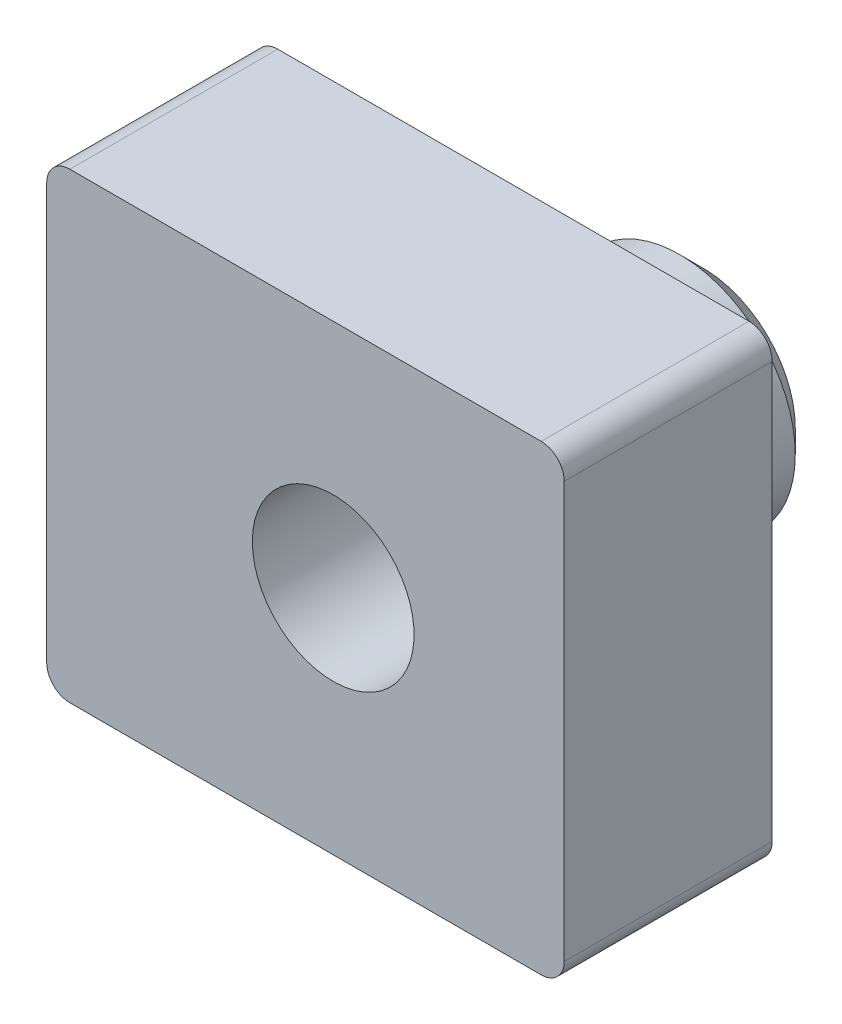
ISO-10303-21;
HEADER;
FILE_DESCRIPTION(('STEP AP214'),'2;1');
FILE_NAME('part.step','',(''),(''),'','','');
FILE_SCHEMA(('AUTOMOTIVE_DESIGN { 1 0 10303 214 1 1 1 1 }'));
ENDSEC;
DATA;
#1=APPLICATION_CONTEXT('core data for automotive mechanical design processes');
#2=APPLICATION_PROTOCOL_DEFINITION('international standard','automotive_design',2000,#1);
#3=PRODUCT_CONTEXT('',#1,'mechanical');
#4=PRODUCT('Part','Part','',(#3));
#5=PRODUCT_RELATED_PRODUCT_CATEGORY('part','',(#4));
#6=PRODUCT_DEFINITION_FORMATION('','',#4);
#7=PRODUCT_DEFINITION_CONTEXT('part definition',#1,'design');
#8=PRODUCT_DEFINITION('design','',#6,#7);
#9=PRODUCT_DEFINITION_SHAPE('','',#8);
#10=(LENGTH_UNIT() NAMED_UNIT(*) SI_UNIT(.MILLI.,.METRE.));
#11=(NAMED_UNIT(*) PLANE_ANGLE_UNIT() SI_UNIT($,.RADIAN.));
#12=(NAMED_UNIT(*) SI_UNIT($,.STERADIAN.) SOLID_ANGLE_UNIT());
#13=UNCERTAINTY_MEASURE_WITH_UNIT(LENGTH_MEASURE(1.E-05),#10,'distance_accuracy_value','');
#14=(GEOMETRIC_REPRESENTATION_CONTEXT(3) GLOBAL_UNCERTAINTY_ASSIGNED_CONTEXT((#13)) GLOBAL_UNIT_ASSIGNED_CONTEXT((#10,
#11,#12)) REPRESENTATION_CONTEXT('',''));
#15=CARTESIAN_POINT('',(0.,0.,0.));
#16=DIRECTION('',(0.,0.,1.));
#17=DIRECTION('',(1.,0.,0.));
#18=AXIS2_PLACEMENT_3D('',#15,#16,#17);
#19=CARTESIAN_POINT('',(10.,0.,-3.));
#20=DIRECTION('',(0.,0.,1.));
#21=DIRECTION('',(1.,0.,0.));
#22=AXIS2_PLACEMENT_3D('',#19,#20,#21);
#23=CYLINDRICAL_SURFACE('',#22,2.5);
#24=CARTESIAN_POINT('',(10.,0.,-2.5));
#25=DIRECTION('',(0.,0.,1.));
#26=DIRECTION('',(1.,0.,0.));
#27=AXIS2_PLACEMENT_3D('',#24,#25,#26);
#28=CIRCLE('',#27,2.5);
#29=CARTESIAN_POINT('',(12.5,0.,-2.5));
#30=VERTEX_POINT('',#29);
#31=EDGE_CURVE('E38',#30,#30,#28,.T.);
#32=ORIENTED_EDGE('',*,*,#31,.T.);
#33=EDGE_LOOP('',(#32));
#34=FACE_BOUND('',#33,.T.);
#35=CARTESIAN_POINT('',(10.,0.,0.));
#36=DIRECTION('',(0.,0.,1.));
#37=DIRECTION('',(1.,0.,0.));
#38=AXIS2_PLACEMENT_3D('',#35,#36,#37);
#39=CIRCLE('',#38,2.5);
#40=CARTESIAN_POINT('',(12.5,0.,0.));
#41=VERTEX_POINT('',#40);
#42=EDGE_CURVE('E224',#41,#41,#39,.T.);
#43=ORIENTED_EDGE('',*,*,#42,.F.);
#44=EDGE_LOOP('',(#43));
#45=FACE_BOUND('',#44,.T.);
#46=ADVANCED_FACE('F31',(#34,#45),#23,.T.);
#47=CARTESIAN_POINT('',(10.,0.,-3.));
#48=DIRECTION('',(0.,0.,1.));
#49=DIRECTION('',(1.,0.,0.));
#50=AXIS2_PLACEMENT_3D('',#47,#48,#49);
#51=PLANE('',#50);
#52=CARTESIAN_POINT('',(10.,0.,-3.));
#53=DIRECTION('',(0.,0.,-1.));
#54=DIRECTION('',(-1.,0.,0.));
#55=AXIS2_PLACEMENT_3D('',#52,#53,#54);
#56=CIRCLE('',#55,1.75);
#57=CARTESIAN_POINT('',(8.25,0.,-3.));
#58=VERTEX_POINT('',#57);
#59=EDGE_CURVE('E149',#58,#58,#56,.T.);
#60=ORIENTED_EDGE('',*,*,#59,.F.);
#61=EDGE_LOOP('',(#60));
#62=FACE_BOUND('',#61,.T.);
#63=CARTESIAN_POINT('',(10.,0.,-3.));
#64=DIRECTION('',(0.,0.,1.));
#65=DIRECTION('',(1.,0.,0.));
#66=AXIS2_PLACEMENT_3D('',#63,#64,#65);
#67=CIRCLE('',#66,2.);
#68=CARTESIAN_POINT('',(12.,0.,-3.));
#69=VERTEX_POINT('',#68);
#70=EDGE_CURVE('E11',#69,#69,#67,.F.);
#71=ORIENTED_EDGE('',*,*,#70,.T.);
#72=EDGE_LOOP('',(#71));
#73=FACE_BOUND('',#72,.T.);
#74=ADVANCED_FACE('F249',(#62,#73),#51,.F.);
#75=CARTESIAN_POINT('',(10.,0.,0.5));
#76=DIRECTION('',(0.,0.,-1.));
#77=DIRECTION('',(-1.,0.,0.));
#78=AXIS2_PLACEMENT_3D('',#75,#76,#77);
#79=CYLINDRICAL_SURFACE('',#78,3.975);
#80=CARTESIAN_POINT('',(10.,0.,0.));
#81=DIRECTION('',(0.,0.,1.));
#82=DIRECTION('',(1.,0.,0.));
#83=AXIS2_PLACEMENT_3D('',#80,#81,#82);
#84=CIRCLE('',#83,3.975);
#85=CARTESIAN_POINT('',(8.11568978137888,3.5,0.));
#86=VERTEX_POINT('',#85);
#87=CARTESIAN_POINT('',(8.11568978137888,-3.5,0.));
#88=VERTEX_POINT('',#87);
#89=EDGE_CURVE('E139',#86,#88,#84,.T.);
#90=ORIENTED_EDGE('',*,*,#89,.T.);
#91=DIRECTION('',(0.,0.,-1.));
#92=VECTOR('',#91,1.);
#93=CARTESIAN_POINT('',(8.11568978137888,-3.5,0.5));
#94=LINE('',#93,#92);
#95=CARTESIAN_POINT('',(8.11568978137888,-3.5,0.5));
#96=VERTEX_POINT('',#95);
#97=EDGE_CURVE('E221',#96,#88,#94,.T.);
#98=ORIENTED_EDGE('',*,*,#97,.F.);
#99=CARTESIAN_POINT('',(10.,0.,0.5));
#100=DIRECTION('',(0.,0.,1.));
#101=DIRECTION('',(1.,0.,0.));
#102=AXIS2_PLACEMENT_3D('',#99,#100,#101);
#103=CIRCLE('',#102,3.975);
#104=CARTESIAN_POINT('',(8.11568978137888,3.5,0.5));
#105=VERTEX_POINT('',#104);
#106=EDGE_CURVE('E204',#105,#96,#103,.T.);
#107=ORIENTED_EDGE('',*,*,#106,.F.);
#108=DIRECTION('',(0.,0.,-1.));
#109=VECTOR('',#108,1.);
#110=CARTESIAN_POINT('',(8.11568978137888,3.5,0.5));
#111=LINE('',#110,#109);
#112=EDGE_CURVE('E216',#105,#86,#111,.T.);
#113=ORIENTED_EDGE('',*,*,#112,.T.);
#114=EDGE_LOOP('',(#90,#98,#107,#113));
#115=FACE_BOUND('',#114,.T.);
#116=ADVANCED_FACE('F253',(#115),#79,.T.);
#117=CARTESIAN_POINT('',(8.11568978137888,-3.5,0.5));
#118=DIRECTION('',(0.,1.,0.));
#119=DIRECTION('',(0.,0.,1.));
#120=AXIS2_PLACEMENT_3D('',#117,#118,#119);
#121=PLANE('',#120);
#122=DIRECTION('',(1.,0.,0.));
#123=VECTOR('',#122,1.);
#124=CARTESIAN_POINT('',(8.11568978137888,-3.5,0.));
#125=LINE('',#124,#123);
#126=CARTESIAN_POINT('',(11.8843102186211,-3.5,0.));
#127=VERTEX_POINT('',#126);
#128=EDGE_CURVE('E198',#88,#127,#125,.T.);
#129=ORIENTED_EDGE('',*,*,#128,.T.);
#130=DIRECTION('',(0.,0.,-1.));
#131=VECTOR('',#130,1.);
#132=CARTESIAN_POINT('',(11.8843102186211,-3.5,0.5));
#133=LINE('',#132,#131);
#134=CARTESIAN_POINT('',(11.8843102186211,-3.5,0.5));
#135=VERTEX_POINT('',#134);
#136=EDGE_CURVE('E53',#135,#127,#133,.T.);
#137=ORIENTED_EDGE('',*,*,#136,.F.);
#138=DIRECTION('',(1.,0.,0.));
#139=VECTOR('',#138,1.);
#140=CARTESIAN_POINT('',(8.11568978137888,-3.5,0.5));
#141=LINE('',#140,#139);
#142=EDGE_CURVE('E207',#96,#135,#141,.T.);
#143=ORIENTED_EDGE('',*,*,#142,.F.);
#144=ORIENTED_EDGE('',*,*,#97,.T.);
#145=EDGE_LOOP('',(#129,#137,#143,#144));
#146=FACE_BOUND('',#145,.T.);
#147=ADVANCED_FACE('F258',(#146),#121,.F.);
#148=CARTESIAN_POINT('',(10.,0.,0.5));
#149=DIRECTION('',(0.,0.,-1.));
#150=DIRECTION('',(-1.,0.,0.));
#151=AXIS2_PLACEMENT_3D('',#148,#149,#150);
#152=CYLINDRICAL_SURFACE('',#151,3.975);
#153=CARTESIAN_POINT('',(10.,0.,0.));
#154=DIRECTION('',(0.,0.,1.));
#155=DIRECTION('',(1.,0.,0.));
#156=AXIS2_PLACEMENT_3D('',#153,#154,#155);
#157=CIRCLE('',#156,3.975);
#158=CARTESIAN_POINT('',(11.8843102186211,3.5,0.));
#159=VERTEX_POINT('',#158);
#160=EDGE_CURVE('E200',#127,#159,#157,.T.);
#161=ORIENTED_EDGE('',*,*,#160,.T.);
#162=DIRECTION('',(0.,0.,-1.));
#163=VECTOR('',#162,1.);
#164=CARTESIAN_POINT('',(11.8843102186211,3.5,0.5));
#165=LINE('',#164,#163);
#166=CARTESIAN_POINT('',(11.8843102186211,3.5,0.5));
#167=VERTEX_POINT('',#166);
#168=EDGE_CURVE('E45',#167,#159,#165,.T.);
#169=ORIENTED_EDGE('',*,*,#168,.F.);
#170=CARTESIAN_POINT('',(10.,0.,0.5));
#171=DIRECTION('',(0.,0.,1.));
#172=DIRECTION('',(1.,0.,0.));
#173=AXIS2_PLACEMENT_3D('',#170,#171,#172);
#174=CIRCLE('',#173,3.975);
#175=EDGE_CURVE('E210',#135,#167,#174,.T.);
#176=ORIENTED_EDGE('',*,*,#175,.F.);
#177=ORIENTED_EDGE('',*,*,#136,.T.);
#178=EDGE_LOOP('',(#161,#169,#176,#177));
#179=FACE_BOUND('',#178,.T.);
#180=ADVANCED_FACE('F266',(#179),#152,.T.);
#181=CARTESIAN_POINT('',(11.8843102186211,3.5,0.5));
#182=DIRECTION('',(0.,-1.,0.));
#183=DIRECTION('',(1.,0.,0.));
#184=AXIS2_PLACEMENT_3D('',#181,#182,#183);
#185=PLANE('',#184);
#186=DIRECTION('',(-1.,0.,0.));
#187=VECTOR('',#186,1.);
#188=CARTESIAN_POINT('',(11.8843102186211,3.5,0.));
#189=LINE('',#188,#187);
#190=EDGE_CURVE('E202',#159,#86,#189,.T.);
#191=ORIENTED_EDGE('',*,*,#190,.T.);
#192=ORIENTED_EDGE('',*,*,#112,.F.);
#193=DIRECTION('',(-1.,0.,0.));
#194=VECTOR('',#193,1.);
#195=CARTESIAN_POINT('',(11.8843102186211,3.5,0.5));
#196=LINE('',#195,#194);
#197=EDGE_CURVE('E213',#167,#105,#196,.T.);
#198=ORIENTED_EDGE('',*,*,#197,.F.);
#199=ORIENTED_EDGE('',*,*,#168,.T.);
#200=EDGE_LOOP('',(#191,#192,#198,#199));
#201=FACE_BOUND('',#200,.T.);
#202=ADVANCED_FACE('F269',(#201),#185,.F.);
#203=CARTESIAN_POINT('',(10.,0.,0.));
#204=DIRECTION('',(0.,0.,1.));
#205=DIRECTION('',(1.,0.,0.));
#206=AXIS2_PLACEMENT_3D('',#203,#204,#205);
#207=PLANE('',#206);
#208=ORIENTED_EDGE('',*,*,#42,.T.);
#209=EDGE_LOOP('',(#208));
#210=FACE_BOUND('',#209,.T.);
#211=ORIENTED_EDGE('',*,*,#89,.F.);
#212=ORIENTED_EDGE('',*,*,#190,.F.);
#213=ORIENTED_EDGE('',*,*,#160,.F.);
#214=ORIENTED_EDGE('',*,*,#128,.F.);
#215=EDGE_LOOP('',(#211,#212,#213,#214));
#216=FACE_BOUND('',#215,.T.);
#217=ADVANCED_FACE('F272',(#210,#216),#207,.F.);
#218=CARTESIAN_POINT('',(14.5,-4.5,0.5));
#219=DIRECTION('',(0.,0.,1.));
#220=DIRECTION('',(1.,0.,0.));
#221=AXIS2_PLACEMENT_3D('',#218,#219,#220);
#222=PLANE('',#221);
#223=CARTESIAN_POINT('',(14.5,-4.5,0.5));
#224=DIRECTION('',(0.,0.,1.));
#225=DIRECTION('',(1.,0.,0.));
#226=AXIS2_PLACEMENT_3D('',#223,#224,#225);
#227=CIRCLE('',#226,0.5);
#228=CARTESIAN_POINT('',(14.5,-5.,0.5));
#229=VERTEX_POINT('',#228);
#230=CARTESIAN_POINT('',(15.,-4.5,0.5));
#231=VERTEX_POINT('',#230);
#232=EDGE_CURVE('E125',#229,#231,#227,.T.);
#233=ORIENTED_EDGE('',*,*,#232,.F.);
#234=DIRECTION('',(1.,0.,0.));
#235=VECTOR('',#234,1.);
#236=CARTESIAN_POINT('',(4.30000000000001,-5.,0.5));
#237=LINE('',#236,#235);
#238=CARTESIAN_POINT('',(4.30000000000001,-5.,0.5));
#239=VERTEX_POINT('',#238);
#240=EDGE_CURVE('E162',#239,#229,#237,.T.);
#241=ORIENTED_EDGE('',*,*,#240,.F.);
#242=CARTESIAN_POINT('',(4.30000000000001,-4.5,0.5));
#243=DIRECTION('',(0.,0.,1.));
#244=DIRECTION('',(1.,0.,0.));
#245=AXIS2_PLACEMENT_3D('',#242,#243,#244);
#246=CIRCLE('',#245,0.5);
#247=CARTESIAN_POINT('',(3.80000000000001,-4.5,0.5));
#248=VERTEX_POINT('',#247);
#249=EDGE_CURVE('E160',#248,#239,#246,.T.);
#250=ORIENTED_EDGE('',*,*,#249,.F.);
#251=DIRECTION('',(0.,-1.,0.));
#252=VECTOR('',#251,1.);
#253=CARTESIAN_POINT('',(3.80000000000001,-4.5,0.5));
#254=LINE('',#253,#252);
#255=CARTESIAN_POINT('',(3.80000000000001,4.5,0.5));
#256=VERTEX_POINT('',#255);
#257=EDGE_CURVE('E158',#256,#248,#254,.T.);
#258=ORIENTED_EDGE('',*,*,#257,.F.);
#259=CARTESIAN_POINT('',(4.30000000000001,4.5,0.5));
#260=DIRECTION('',(0.,0.,1.));
#261=DIRECTION('',(1.,0.,0.));
#262=AXIS2_PLACEMENT_3D('',#259,#260,#261);
#263=CIRCLE('',#262,0.5);
#264=CARTESIAN_POINT('',(4.30000000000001,5.,0.5));
#265=VERTEX_POINT('',#264);
#266=EDGE_CURVE('E156',#265,#256,#263,.T.);
#267=ORIENTED_EDGE('',*,*,#266,.F.);
#268=DIRECTION('',(-1.,0.,0.));
#269=VECTOR('',#268,1.);
#270=CARTESIAN_POINT('',(14.5,5.,0.5));
#271=LINE('',#270,#269);
#272=CARTESIAN_POINT('',(14.5,5.,0.5));
#273=VERTEX_POINT('',#272);
#274=EDGE_CURVE('E154',#273,#265,#271,.T.);
#275=ORIENTED_EDGE('',*,*,#274,.F.);
#276=CARTESIAN_POINT('',(14.5,4.5,0.5));
#277=DIRECTION('',(0.,0.,1.));
#278=DIRECTION('',(1.,0.,0.));
#279=AXIS2_PLACEMENT_3D('',#276,#277,#278);
#280=CIRCLE('',#279,0.5);
#281=CARTESIAN_POINT('',(15.,4.5,0.5));
#282=VERTEX_POINT('',#281);
#283=EDGE_CURVE('E127',#282,#273,#280,.T.);
#284=ORIENTED_EDGE('',*,*,#283,.F.);
#285=DIRECTION('',(0.,1.,0.));
#286=VECTOR('',#285,1.);
#287=CARTESIAN_POINT('',(15.,-4.5,0.5));
#288=LINE('',#287,#286);
#289=EDGE_CURVE('E119',#231,#282,#288,.T.);
#290=ORIENTED_EDGE('',*,*,#289,.F.);
#291=EDGE_LOOP('',(#233,#241,#250,#258,#267,#275,#284,#290));
#292=FACE_BOUND('',#291,.T.);
#293=ORIENTED_EDGE('',*,*,#197,.T.);
#294=ORIENTED_EDGE('',*,*,#106,.T.);
#295=ORIENTED_EDGE('',*,*,#142,.T.);
#296=ORIENTED_EDGE('',*,*,#175,.T.);
#297=EDGE_LOOP('',(#293,#294,#295,#296));
#298=FACE_BOUND('',#297,.T.);
#299=ADVANCED_FACE('F121',(#292,#298),#222,.F.);
#300=CARTESIAN_POINT('',(14.5,-4.5,5.));
#301=DIRECTION('',(0.,0.,-1.));
#302=DIRECTION('',(-1.,0.,0.));
#303=AXIS2_PLACEMENT_3D('',#300,#301,#302);
#304=CYLINDRICAL_SURFACE('',#303,0.5);
#305=ORIENTED_EDGE('',*,*,#232,.T.);
#306=DIRECTION('',(0.,0.,-1.));
#307=VECTOR('',#306,1.);
#308=CARTESIAN_POINT('',(15.,-4.5,5.));
#309=LINE('',#308,#307);
#310=CARTESIAN_POINT('',(15.,-4.5,5.));
#311=VERTEX_POINT('',#310);
#312=EDGE_CURVE('E133',#311,#231,#309,.T.);
#313=ORIENTED_EDGE('',*,*,#312,.F.);
#314=CARTESIAN_POINT('',(14.5,-4.5,5.));
#315=DIRECTION('',(0.,0.,1.));
#316=DIRECTION('',(1.,0.,0.));
#317=AXIS2_PLACEMENT_3D('',#314,#315,#316);
#318=CIRCLE('',#317,0.5);
#319=CARTESIAN_POINT('',(14.5,-5.,5.));
#320=VERTEX_POINT('',#319);
#321=EDGE_CURVE('E164',#320,#311,#318,.T.);
#322=ORIENTED_EDGE('',*,*,#321,.F.);
#323=DIRECTION('',(0.,0.,-1.));
#324=VECTOR('',#323,1.);
#325=CARTESIAN_POINT('',(14.5,-5.,5.));
#326=LINE('',#325,#324);
#327=EDGE_CURVE('E145',#320,#229,#326,.T.);
#328=ORIENTED_EDGE('',*,*,#327,.T.);
#329=EDGE_LOOP('',(#305,#313,#322,#328));
#330=FACE_BOUND('',#329,.T.);
#331=ADVANCED_FACE('F143',(#330),#304,.T.);
#332=CARTESIAN_POINT('',(15.,-4.5,5.));
#333=DIRECTION('',(-1.,0.,0.));
#334=DIRECTION('',(0.,0.,1.));
#335=AXIS2_PLACEMENT_3D('',#332,#333,#334);
#336=PLANE('',#335);
#337=ORIENTED_EDGE('',*,*,#289,.T.);
#338=DIRECTION('',(0.,0.,-1.));
#339=VECTOR('',#338,1.);
#340=CARTESIAN_POINT('',(15.,4.5,5.));
#341=LINE('',#340,#339);
#342=CARTESIAN_POINT('',(15.,4.5,5.));
#343=VERTEX_POINT('',#342);
#344=EDGE_CURVE('E140',#343,#282,#341,.T.);
#345=ORIENTED_EDGE('',*,*,#344,.F.);
#346=DIRECTION('',(0.,1.,0.));
#347=VECTOR('',#346,1.);
#348=CARTESIAN_POINT('',(15.,-4.5,5.));
#349=LINE('',#348,#347);
#350=EDGE_CURVE('E135',#311,#343,#349,.T.);
#351=ORIENTED_EDGE('',*,*,#350,.F.);
#352=ORIENTED_EDGE('',*,*,#312,.T.);
#353=EDGE_LOOP('',(#337,#345,#351,#352));
#354=FACE_BOUND('',#353,.T.);
#355=ADVANCED_FACE('F134',(#354),#336,.F.);
#356=CARTESIAN_POINT('',(14.5,4.5,5.));
#357=DIRECTION('',(0.,0.,-1.));
#358=DIRECTION('',(-1.,0.,0.));
#359=AXIS2_PLACEMENT_3D('',#356,#357,#358);
#360=CYLINDRICAL_SURFACE('',#359,0.5);
#361=ORIENTED_EDGE('',*,*,#283,.T.);
#362=DIRECTION('',(0.,0.,-1.));
#363=VECTOR('',#362,1.);
#364=CARTESIAN_POINT('',(14.5,5.,5.));
#365=LINE('',#364,#363);
#366=CARTESIAN_POINT('',(14.5,5.,5.));
#367=VERTEX_POINT('',#366);
#368=EDGE_CURVE('E192',#367,#273,#365,.T.);
#369=ORIENTED_EDGE('',*,*,#368,.F.);
#370=CARTESIAN_POINT('',(14.5,4.5,5.));
#371=DIRECTION('',(0.,0.,1.));
#372=DIRECTION('',(1.,0.,0.));
#373=AXIS2_PLACEMENT_3D('',#370,#371,#372);
#374=CIRCLE('',#373,0.5);
#375=EDGE_CURVE('E167',#343,#367,#374,.T.);
#376=ORIENTED_EDGE('',*,*,#375,.F.);
#377=ORIENTED_EDGE('',*,*,#344,.T.);
#378=EDGE_LOOP('',(#361,#369,#376,#377));
#379=FACE_BOUND('',#378,.T.);
#380=ADVANCED_FACE('F281',(#379),#360,.T.);
#381=CARTESIAN_POINT('',(14.5,5.,5.));
#382=DIRECTION('',(0.,-1.,0.));
#383=DIRECTION('',(1.,0.,0.));
#384=AXIS2_PLACEMENT_3D('',#381,#382,#383);
#385=PLANE('',#384);
#386=ORIENTED_EDGE('',*,*,#274,.T.);
#387=DIRECTION('',(0.,0.,-1.));
#388=VECTOR('',#387,1.);
#389=CARTESIAN_POINT('',(4.30000000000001,5.,5.));
#390=LINE('',#389,#388);
#391=CARTESIAN_POINT('',(4.30000000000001,5.,5.));
#392=VERTEX_POINT('',#391);
#393=EDGE_CURVE('E189',#392,#265,#390,.T.);
#394=ORIENTED_EDGE('',*,*,#393,.F.);
#395=DIRECTION('',(-1.,0.,0.));
#396=VECTOR('',#395,1.);
#397=CARTESIAN_POINT('',(14.5,5.,5.));
#398=LINE('',#397,#396);
#399=EDGE_CURVE('E169',#367,#392,#398,.T.);
#400=ORIENTED_EDGE('',*,*,#399,.F.);
#401=ORIENTED_EDGE('',*,*,#368,.T.);
#402=EDGE_LOOP('',(#386,#394,#400,#401));
#403=FACE_BOUND('',#402,.T.);
#404=ADVANCED_FACE('F284',(#403),#385,.F.);
#405=CARTESIAN_POINT('',(4.30000000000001,4.5,5.));
#406=DIRECTION('',(0.,0.,-1.));
#407=DIRECTION('',(-1.,0.,0.));
#408=AXIS2_PLACEMENT_3D('',#405,#406,#407);
#409=CYLINDRICAL_SURFACE('',#408,0.5);
#410=ORIENTED_EDGE('',*,*,#266,.T.);
#411=DIRECTION('',(0.,0.,-1.));
#412=VECTOR('',#411,1.);
#413=CARTESIAN_POINT('',(3.80000000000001,4.5,5.));
#414=LINE('',#413,#412);
#415=CARTESIAN_POINT('',(3.80000000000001,4.5,5.));
#416=VERTEX_POINT('',#415);
#417=EDGE_CURVE('E186',#416,#256,#414,.T.);
#418=ORIENTED_EDGE('',*,*,#417,.F.);
#419=CARTESIAN_POINT('',(4.30000000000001,4.5,5.));
#420=DIRECTION('',(0.,0.,1.));
#421=DIRECTION('',(1.,0.,0.));
#422=AXIS2_PLACEMENT_3D('',#419,#420,#421);
#423=CIRCLE('',#422,0.5);
#424=EDGE_CURVE('E171',#392,#416,#423,.T.);
#425=ORIENTED_EDGE('',*,*,#424,.F.);
#426=ORIENTED_EDGE('',*,*,#393,.T.);
#427=EDGE_LOOP('',(#410,#418,#425,#426));
#428=FACE_BOUND('',#427,.T.);
#429=ADVANCED_FACE('F288',(#428),#409,.T.);
#430=CARTESIAN_POINT('',(3.80000000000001,-4.5,5.));
#431=DIRECTION('',(1.,0.,0.));
#432=DIRECTION('',(0.,0.,-1.));
#433=AXIS2_PLACEMENT_3D('',#430,#431,#432);
#434=PLANE('',#433);
#435=ORIENTED_EDGE('',*,*,#257,.T.);
#436=DIRECTION('',(0.,0.,-1.));
#437=VECTOR('',#436,1.);
#438=CARTESIAN_POINT('',(3.80000000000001,-4.5,5.));
#439=LINE('',#438,#437);
#440=CARTESIAN_POINT('',(3.80000000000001,-4.5,5.));
#441=VERTEX_POINT('',#440);
#442=EDGE_CURVE('E183',#441,#248,#439,.T.);
#443=ORIENTED_EDGE('',*,*,#442,.F.);
#444=DIRECTION('',(0.,-1.,0.));
#445=VECTOR('',#444,1.);
#446=CARTESIAN_POINT('',(3.80000000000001,-4.5,5.));
#447=LINE('',#446,#445);
#448=EDGE_CURVE('E173',#416,#441,#447,.T.);
#449=ORIENTED_EDGE('',*,*,#448,.F.);
#450=ORIENTED_EDGE('',*,*,#417,.T.);
#451=EDGE_LOOP('',(#435,#443,#449,#450));
#452=FACE_BOUND('',#451,.T.);
#453=ADVANCED_FACE('F292',(#452),#434,.F.);
#454=CARTESIAN_POINT('',(4.30000000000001,-4.5,5.));
#455=DIRECTION('',(0.,0.,-1.));
#456=DIRECTION('',(-1.,0.,0.));
#457=AXIS2_PLACEMENT_3D('',#454,#455,#456);
#458=CYLINDRICAL_SURFACE('',#457,0.5);
#459=ORIENTED_EDGE('',*,*,#249,.T.);
#460=DIRECTION('',(0.,0.,-1.));
#461=VECTOR('',#460,1.);
#462=CARTESIAN_POINT('',(4.30000000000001,-5.,5.));
#463=LINE('',#462,#461);
#464=CARTESIAN_POINT('',(4.30000000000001,-5.,5.));
#465=VERTEX_POINT('',#464);
#466=EDGE_CURVE('E180',#465,#239,#463,.T.);
#467=ORIENTED_EDGE('',*,*,#466,.F.);
#468=CARTESIAN_POINT('',(4.30000000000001,-4.5,5.));
#469=DIRECTION('',(0.,0.,1.));
#470=DIRECTION('',(1.,0.,0.));
#471=AXIS2_PLACEMENT_3D('',#468,#469,#470);
#472=CIRCLE('',#471,0.5);
#473=EDGE_CURVE('E175',#441,#465,#472,.T.);
#474=ORIENTED_EDGE('',*,*,#473,.F.);
#475=ORIENTED_EDGE('',*,*,#442,.T.);
#476=EDGE_LOOP('',(#459,#467,#474,#475));
#477=FACE_BOUND('',#476,.T.);
#478=ADVANCED_FACE('F296',(#477),#458,.T.);
#479=CARTESIAN_POINT('',(4.30000000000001,-5.,5.));
#480=DIRECTION('',(0.,1.,0.));
#481=DIRECTION('',(-1.,0.,0.));
#482=AXIS2_PLACEMENT_3D('',#479,#480,#481);
#483=PLANE('',#482);
#484=ORIENTED_EDGE('',*,*,#240,.T.);
#485=ORIENTED_EDGE('',*,*,#327,.F.);
#486=DIRECTION('',(1.,0.,0.));
#487=VECTOR('',#486,1.);
#488=CARTESIAN_POINT('',(4.30000000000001,-5.,5.));
#489=LINE('',#488,#487);
#490=EDGE_CURVE('E177',#465,#320,#489,.T.);
#491=ORIENTED_EDGE('',*,*,#490,.F.);
#492=ORIENTED_EDGE('',*,*,#466,.T.);
#493=EDGE_LOOP('',(#484,#485,#491,#492));
#494=FACE_BOUND('',#493,.T.);
#495=ADVANCED_FACE('F243',(#494),#483,.F.);
#496=CARTESIAN_POINT('',(14.5,-4.5,5.));
#497=DIRECTION('',(0.,0.,1.));
#498=DIRECTION('',(1.,0.,0.));
#499=AXIS2_PLACEMENT_3D('',#496,#497,#498);
#500=PLANE('',#499);
#501=CARTESIAN_POINT('',(10.,0.,5.));
#502=DIRECTION('',(0.,0.,-1.));
#503=DIRECTION('',(-1.,0.,0.));
#504=AXIS2_PLACEMENT_3D('',#501,#502,#503);
#505=CIRCLE('',#504,1.75);
#506=CARTESIAN_POINT('',(8.25,0.,5.));
#507=VERTEX_POINT('',#506);
#508=EDGE_CURVE('E146',#507,#507,#505,.T.);
#509=ORIENTED_EDGE('',*,*,#508,.T.);
#510=EDGE_LOOP('',(#509));
#511=FACE_BOUND('',#510,.T.);
#512=ORIENTED_EDGE('',*,*,#321,.T.);
#513=ORIENTED_EDGE('',*,*,#350,.T.);
#514=ORIENTED_EDGE('',*,*,#375,.T.);
#515=ORIENTED_EDGE('',*,*,#399,.T.);
#516=ORIENTED_EDGE('',*,*,#424,.T.);
#517=ORIENTED_EDGE('',*,*,#448,.T.);
#518=ORIENTED_EDGE('',*,*,#473,.T.);
#519=ORIENTED_EDGE('',*,*,#490,.T.);
#520=EDGE_LOOP('',(#512,#513,#514,#515,#516,#517,#518,#519));
#521=FACE_BOUND('',#520,.T.);
#522=ADVANCED_FACE('F234',(#511,#521),#500,.T.);
#523=CARTESIAN_POINT('',(10.,0.,-2.5));
#524=DIRECTION('',(0.,0.,1.));
#525=DIRECTION('',(1.,0.,0.));
#526=AXIS2_PLACEMENT_3D('',#523,#524,#525);
#527=CONICAL_SURFACE('',#526,2.5,0.78539816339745);
#528=ORIENTED_EDGE('',*,*,#70,.F.);
#529=EDGE_LOOP('',(#528));
#530=FACE_BOUND('',#529,.T.);
#531=ORIENTED_EDGE('',*,*,#31,.F.);
#532=EDGE_LOOP('',(#531));
#533=FACE_BOUND('',#532,.T.);
#534=ADVANCED_FACE('F231',(#530,#533),#527,.T.);
#535=CARTESIAN_POINT('',(10.,0.,5.));
#536=DIRECTION('',(0.,0.,-1.));
#537=DIRECTION('',(-1.,0.,0.));
#538=AXIS2_PLACEMENT_3D('',#535,#536,#537);
#539=CYLINDRICAL_SURFACE('',#538,1.75);
#540=ORIENTED_EDGE('',*,*,#508,.F.);
#541=EDGE_LOOP('',(#540));
#542=FACE_BOUND('',#541,.T.);
#543=ORIENTED_EDGE('',*,*,#59,.T.);
#544=EDGE_LOOP('',(#543));
#545=FACE_BOUND('',#544,.T.);
#546=ADVANCED_FACE('F233',(#542,#545),#539,.F.);
#547=CLOSED_SHELL('',(#46,#74,#116,#147,#180,#202,#217,#299,#331,#355,#380,#404,#429,#453,#478,
#495,#522,#534,#546));
#548=MANIFOLD_SOLID_BREP('B2',#547);
#549=ADVANCED_BREP_SHAPE_REPRESENTATION('',(#18,#548),#14);
#550=SHAPE_DEFINITION_REPRESENTATION(#9,#549);
ENDSEC;
END-ISO-10303-21;
